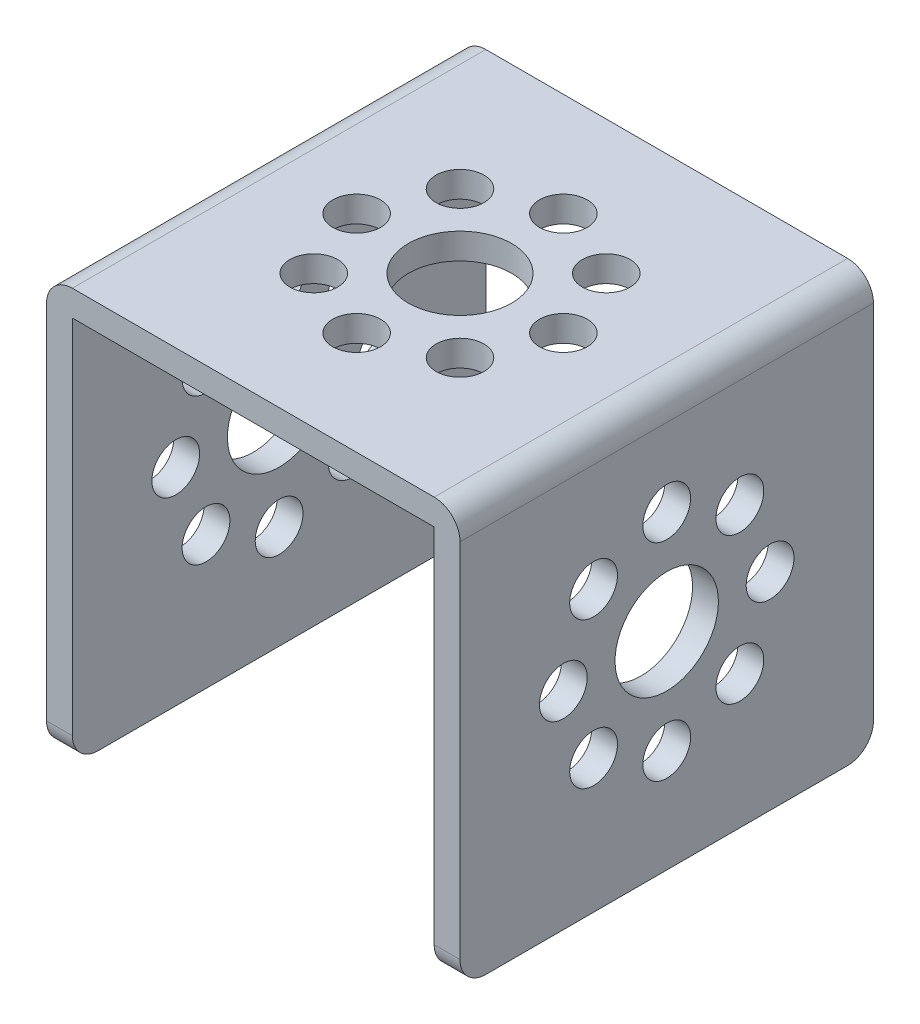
from build123d import *

# Parameters (mm, degrees)
BOSS_EXTRUDE1_DEPTH = 32
SKETCH2_R           = 1.85
SKETCH2_R_2         = 4
CUT_EXTRUDE1_DEPTH  = 49
SKETCH3_R           = 1.85
SKETCH3_R_2         = 4
CUT_EXTRUDE2_DEPTH  = 49
FILLET1_R           = 2


with BuildPart() as part:
    # Sketch1 → Boss-Extrude1 (new body)
    with BuildSketch(Plane.XY):
        Polygon((14, -16), (16, -16), (16, 16), (-16, 16), (-16, -16), (-14, -16), (-14, 14), (14, 14), align=None)
    extrude(amount=-BOSS_EXTRUDE1_DEPTH)

    # Sketch2 → Cut-Extrude1 (cut, through all)
    with BuildSketch(Plane(origin=(0, 16, 0), x_dir=(1, 0, 0), z_dir=(0, 1, 0))):
        with Locations(Location((8, 16, 0), (0, 0, 270))):
            Circle(SKETCH2_R)
        with Locations(Location((0, 8, 0), (0, 0, 270))):
            Circle(SKETCH2_R)
        with Locations(Location((0, 16, 0), (0, 0, 270))):
            Circle(SKETCH2_R_2)
        with Locations(Location((0, 24, 0), (0, 0, 270))):
            Circle(SKETCH2_R)
        with Locations(Location((-5.66, 21.66, 0), (0, 0, 270))):
            Circle(SKETCH2_R)
        with Locations(Location((-5.66, 10.34, 0), (0, 0, 270))):
            Circle(SKETCH2_R)
        with Locations(Location((-8, 16, 0), (0, 0, 270))):
            Circle(SKETCH2_R)
        with Locations(Location((5.66, 21.66, 0), (0, 0, 270))):
            Circle(SKETCH2_R)
        with Locations(Location((5.66, 10.34, 0), (0, 0, 270))):
            Circle(SKETCH2_R)
    extrude(amount=-CUT_EXTRUDE1_DEPTH, mode=Mode.SUBTRACT)

    # Sketch3 → Cut-Extrude2 (cut, through all)
    with BuildSketch(Plane(origin=(16, 0, 0), x_dir=(0, 0, -1), z_dir=(1, 0, 0))):
        with Locations(Location((24, 0, 0), (0, 0, 90))):
            Circle(SKETCH3_R)
        with Locations(Location((16, -8, 0), (0, 0, 90))):
            Circle(SKETCH3_R)
        with Locations(Location((16, 0, 0), (0, 0, 90))):
            Circle(SKETCH3_R_2)
        with Locations(Location((16, 8, 0), (0, 0, 90))):
            Circle(SKETCH3_R)
        with Locations(Location((10.34, 5.66, 0), (0, 0, 90))):
            Circle(SKETCH3_R)
        with Locations(Location((10.34, -5.66, 0), (0, 0, 90))):
            Circle(SKETCH3_R)
        with Locations(Location((8, 0, 0), (0, 0, 90))):
            Circle(SKETCH3_R)
        with Locations(Location((21.66, 5.66, 0), (0, 0, 90))):
            Circle(SKETCH3_R)
        with Locations(Location((21.66, -5.66, 0), (0, 0, 90))):
            Circle(SKETCH3_R)
    extrude(amount=-CUT_EXTRUDE2_DEPTH, mode=Mode.SUBTRACT)

    # Fillet1
    fillet1_edges = [part.edges().sort_by_distance(p)[0] for p in [
        (-15, -16, -32),
        (-16, 16, -16),
        (16, 16, -16),
        (15, -16, -32),
        (15, -16, 0),
        (-15, -16, 0),
    ]]
    fillet(fillet1_edges, radius=FILLET1_R)


solid = part.part
